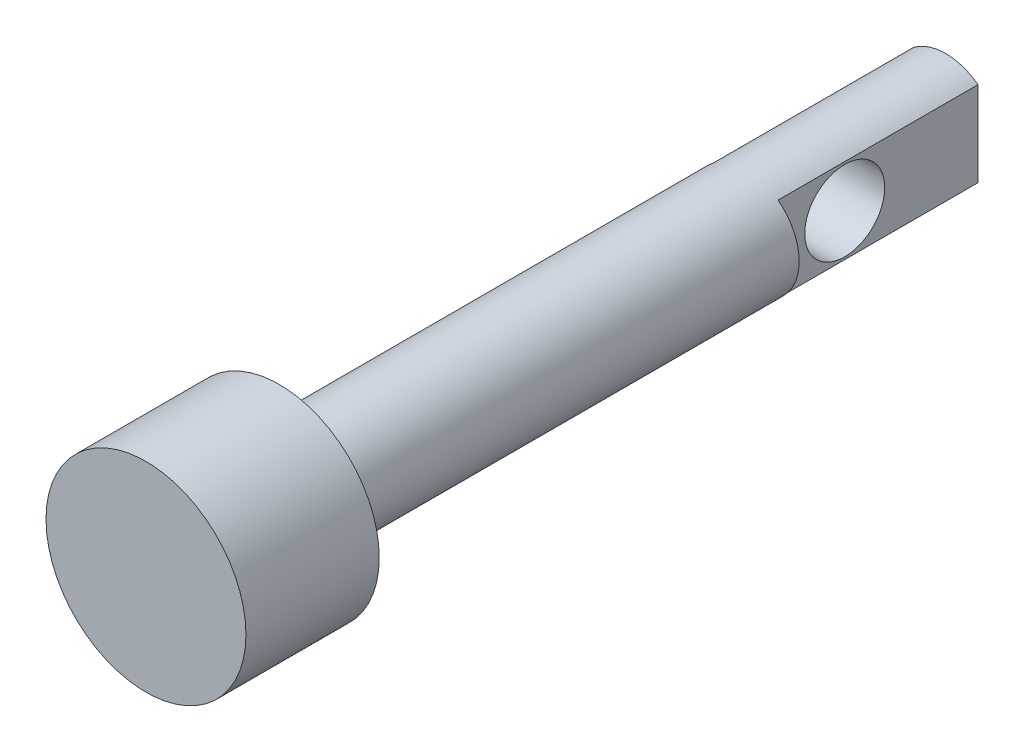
from build123d import *

# Parameters (mm, degrees)
CORTE_EXTRUS_O1_DEPTH      = 64.639610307
CORTE_EXTRUS_O1_DEPTH_BACK = 64.639610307
ESBO_O2_R                  = 6
CORTE_EXTRUS_O2_START      = -30
CORTE_EXTRUS_O2_DEPTH      = 30


with BuildPart() as part:
    # Esbo_o1 → Revolu_o1 (revolve)
    with BuildSketch(Plane(origin=(0, 0, 0), x_dir=(0, 0, -1), z_dir=(1, 0, 0)), mode=Mode.PRIVATE) as revolu_o1_sk:
        Polygon((-60, 0), (60, 0), (60, 8), (-40, 8), (-40, 15), (-60, 15), align=None)
    revolve(revolu_o1_sk.sketch.rotate(Axis((0, 0, 60), (0, 0, -1)), 90), axis=Axis((0, 0, 60), (0, 0, -1)))

    # Esbo_o2 → Corte-extrus_o1 (cut, two sides: drawn at the far end of the back side and taken through both)
    with BuildSketch(Plane(origin=(0, 0, 0), x_dir=(0, 0, -1), z_dir=(1, 0, 0)).offset(-CORTE_EXTRUS_O1_DEPTH_BACK)):
        with Locations((40, 0)):
            Circle(ESBO_O2_R)
    extrude(amount=CORTE_EXTRUS_O1_DEPTH + CORTE_EXTRUS_O1_DEPTH_BACK, mode=Mode.SUBTRACT)

    # Esbo_o3 → Corte-extrus_o2 (cut)
    with BuildSketch(Plane(origin=(0, 0, -60), x_dir=(-1, 0, 0), z_dir=(0, 0, -1)).offset(CORTE_EXTRUS_O2_START)):
        with BuildLine():
            Line((-4.839112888, -6.370477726), (-4.839112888, 6.370477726))
            ThreePointArc((-4.839112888, 6.370477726), (-8, 0), (-4.839112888, -6.370477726))
        make_face()
        with BuildLine():
            ThreePointArc((8, 0), (7.166341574, 3.555776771), (4.839112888, 6.370477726))
            Line((4.839112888, 6.370477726), (4.839112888, -6.370477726))
            ThreePointArc((4.839112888, -6.370477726), (7.166341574, -3.555776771), (8, 0))
        make_face()
    extrude(amount=CORTE_EXTRUS_O2_DEPTH, mode=Mode.SUBTRACT)


solid = part.part
